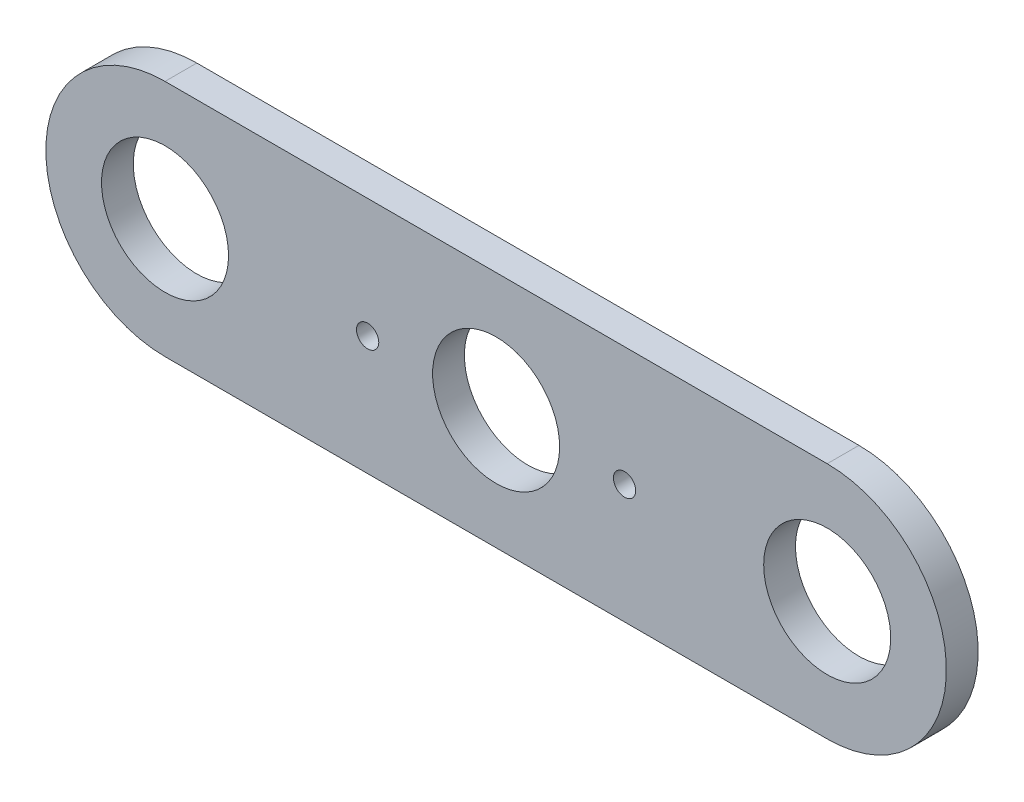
ISO-10303-21;
HEADER;
FILE_DESCRIPTION(('STEP AP214'),'2;1');
FILE_NAME('part.step','',(''),(''),'','','');
FILE_SCHEMA(('AUTOMOTIVE_DESIGN { 1 0 10303 214 1 1 1 1 }'));
ENDSEC;
DATA;
#1=APPLICATION_CONTEXT('core data for automotive mechanical design processes');
#2=APPLICATION_PROTOCOL_DEFINITION('international standard','automotive_design',2000,#1);
#3=PRODUCT_CONTEXT('',#1,'mechanical');
#4=PRODUCT('Part','Part','',(#3));
#5=PRODUCT_RELATED_PRODUCT_CATEGORY('part','',(#4));
#6=PRODUCT_DEFINITION_FORMATION('','',#4);
#7=PRODUCT_DEFINITION_CONTEXT('part definition',#1,'design');
#8=PRODUCT_DEFINITION('design','',#6,#7);
#9=PRODUCT_DEFINITION_SHAPE('','',#8);
#10=(LENGTH_UNIT() NAMED_UNIT(*) SI_UNIT(.MILLI.,.METRE.));
#11=(NAMED_UNIT(*) PLANE_ANGLE_UNIT() SI_UNIT($,.RADIAN.));
#12=(NAMED_UNIT(*) SI_UNIT($,.STERADIAN.) SOLID_ANGLE_UNIT());
#13=UNCERTAINTY_MEASURE_WITH_UNIT(LENGTH_MEASURE(1.E-05),#10,'distance_accuracy_value','');
#14=(GEOMETRIC_REPRESENTATION_CONTEXT(3) GLOBAL_UNCERTAINTY_ASSIGNED_CONTEXT((#13)) GLOBAL_UNIT_ASSIGNED_CONTEXT((#10,
#11,#12)) REPRESENTATION_CONTEXT('',''));
#15=CARTESIAN_POINT('',(0.,0.,0.));
#16=DIRECTION('',(0.,0.,1.));
#17=DIRECTION('',(1.,0.,0.));
#18=AXIS2_PLACEMENT_3D('',#15,#16,#17);
#19=CARTESIAN_POINT('',(62.5,0.,6.));
#20=DIRECTION('',(0.,0.,1.));
#21=DIRECTION('',(1.,0.,0.));
#22=AXIS2_PLACEMENT_3D('',#19,#20,#21);
#23=PLANE('',#22);
#24=CARTESIAN_POINT('',(-24.25,0.,6.));
#25=DIRECTION('',(0.,0.,1.));
#26=DIRECTION('',(1.,0.,0.));
#27=AXIS2_PLACEMENT_3D('',#24,#25,#26);
#28=CIRCLE('',#27,2.1);
#29=CARTESIAN_POINT('',(-22.15,0.,6.));
#30=VERTEX_POINT('',#29);
#31=EDGE_CURVE('E116',#30,#30,#28,.T.);
#32=ORIENTED_EDGE('',*,*,#31,.F.);
#33=EDGE_LOOP('',(#32));
#34=FACE_BOUND('',#33,.T.);
#35=CARTESIAN_POINT('',(24.25,0.,6.));
#36=DIRECTION('',(0.,0.,1.));
#37=DIRECTION('',(-1.,0.,0.));
#38=AXIS2_PLACEMENT_3D('',#35,#36,#37);
#39=CIRCLE('',#38,2.09999999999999);
#40=CARTESIAN_POINT('',(22.15,0.,6.));
#41=VERTEX_POINT('',#40);
#42=EDGE_CURVE('E122',#41,#41,#39,.T.);
#43=ORIENTED_EDGE('',*,*,#42,.F.);
#44=EDGE_LOOP('',(#43));
#45=FACE_BOUND('',#44,.T.);
#46=CARTESIAN_POINT('',(62.5,0.,6.));
#47=DIRECTION('',(0.,0.,1.));
#48=DIRECTION('',(-1.,0.,0.));
#49=AXIS2_PLACEMENT_3D('',#46,#47,#48);
#50=CIRCLE('',#49,11.99);
#51=CARTESIAN_POINT('',(50.51,0.,6.));
#52=VERTEX_POINT('',#51);
#53=EDGE_CURVE('E135',#52,#52,#50,.T.);
#54=ORIENTED_EDGE('',*,*,#53,.F.);
#55=EDGE_LOOP('',(#54));
#56=FACE_BOUND('',#55,.T.);
#57=CARTESIAN_POINT('',(62.5,0.,6.));
#58=DIRECTION('',(0.,0.,1.));
#59=DIRECTION('',(1.,0.,0.));
#60=AXIS2_PLACEMENT_3D('',#57,#58,#59);
#61=CIRCLE('',#60,22.5);
#62=CARTESIAN_POINT('',(62.5,-22.5,6.));
#63=VERTEX_POINT('',#62);
#64=CARTESIAN_POINT('',(62.5,22.5,6.));
#65=VERTEX_POINT('',#64);
#66=EDGE_CURVE('E93',#63,#65,#61,.T.);
#67=ORIENTED_EDGE('',*,*,#66,.T.);
#68=DIRECTION('',(-1.,0.,0.));
#69=VECTOR('',#68,1.);
#70=CARTESIAN_POINT('',(-62.5,22.5,6.));
#71=LINE('',#70,#69);
#72=CARTESIAN_POINT('',(-62.5,22.5,6.));
#73=VERTEX_POINT('',#72);
#74=EDGE_CURVE('E88',#65,#73,#71,.T.);
#75=ORIENTED_EDGE('',*,*,#74,.T.);
#76=CARTESIAN_POINT('',(-62.5,0.,6.));
#77=DIRECTION('',(0.,0.,1.));
#78=DIRECTION('',(-1.,0.,0.));
#79=AXIS2_PLACEMENT_3D('',#76,#77,#78);
#80=CIRCLE('',#79,22.5);
#81=CARTESIAN_POINT('',(-62.5,-22.5,6.));
#82=VERTEX_POINT('',#81);
#83=EDGE_CURVE('E91',#73,#82,#80,.T.);
#84=ORIENTED_EDGE('',*,*,#83,.T.);
#85=DIRECTION('',(1.,0.,0.));
#86=VECTOR('',#85,1.);
#87=CARTESIAN_POINT('',(-62.5,-22.5,6.));
#88=LINE('',#87,#86);
#89=EDGE_CURVE('E58',#82,#63,#88,.T.);
#90=ORIENTED_EDGE('',*,*,#89,.T.);
#91=EDGE_LOOP('',(#67,#75,#84,#90));
#92=FACE_BOUND('',#91,.T.);
#93=CARTESIAN_POINT('',(-62.5,0.,6.));
#94=DIRECTION('',(0.,0.,1.));
#95=DIRECTION('',(1.,0.,0.));
#96=AXIS2_PLACEMENT_3D('',#93,#94,#95);
#97=CIRCLE('',#96,11.99);
#98=CARTESIAN_POINT('',(-50.51,0.,6.));
#99=VERTEX_POINT('',#98);
#100=EDGE_CURVE('E109',#99,#99,#97,.T.);
#101=ORIENTED_EDGE('',*,*,#100,.F.);
#102=EDGE_LOOP('',(#101));
#103=FACE_BOUND('',#102,.T.);
#104=CARTESIAN_POINT('',(0.,0.,6.));
#105=DIRECTION('',(0.,0.,1.));
#106=DIRECTION('',(1.,0.,0.));
#107=AXIS2_PLACEMENT_3D('',#104,#105,#106);
#108=CIRCLE('',#107,11.99);
#109=CARTESIAN_POINT('',(11.99,0.,6.));
#110=VERTEX_POINT('',#109);
#111=EDGE_CURVE('E129',#110,#110,#108,.T.);
#112=ORIENTED_EDGE('',*,*,#111,.F.);
#113=EDGE_LOOP('',(#112));
#114=FACE_BOUND('',#113,.T.);
#115=ADVANCED_FACE('F39',(#34,#45,#56,#92,#103,#114),#23,.T.);
#116=CARTESIAN_POINT('',(62.5,0.,0.));
#117=DIRECTION('',(0.,0.,1.));
#118=DIRECTION('',(1.,0.,0.));
#119=AXIS2_PLACEMENT_3D('',#116,#117,#118);
#120=PLANE('',#119);
#121=CARTESIAN_POINT('',(-24.25,0.,0.));
#122=DIRECTION('',(0.,0.,1.));
#123=DIRECTION('',(1.,0.,0.));
#124=AXIS2_PLACEMENT_3D('',#121,#122,#123);
#125=CIRCLE('',#124,2.1);
#126=CARTESIAN_POINT('',(-22.15,0.,0.));
#127=VERTEX_POINT('',#126);
#128=EDGE_CURVE('E43',#127,#127,#125,.T.);
#129=ORIENTED_EDGE('',*,*,#128,.T.);
#130=EDGE_LOOP('',(#129));
#131=FACE_BOUND('',#130,.T.);
#132=CARTESIAN_POINT('',(24.25,0.,0.));
#133=DIRECTION('',(0.,0.,1.));
#134=DIRECTION('',(1.,0.,0.));
#135=AXIS2_PLACEMENT_3D('',#132,#133,#134);
#136=CIRCLE('',#135,2.09999999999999);
#137=CARTESIAN_POINT('',(26.35,0.,0.));
#138=VERTEX_POINT('',#137);
#139=EDGE_CURVE('E114',#138,#138,#136,.T.);
#140=ORIENTED_EDGE('',*,*,#139,.T.);
#141=EDGE_LOOP('',(#140));
#142=FACE_BOUND('',#141,.T.);
#143=CARTESIAN_POINT('',(62.5,0.,0.));
#144=DIRECTION('',(0.,0.,1.));
#145=DIRECTION('',(1.,0.,0.));
#146=AXIS2_PLACEMENT_3D('',#143,#144,#145);
#147=CIRCLE('',#146,22.5);
#148=CARTESIAN_POINT('',(62.5,-22.5,0.));
#149=VERTEX_POINT('',#148);
#150=CARTESIAN_POINT('',(62.5,22.5,0.));
#151=VERTEX_POINT('',#150);
#152=EDGE_CURVE('E106',#149,#151,#147,.T.);
#153=ORIENTED_EDGE('',*,*,#152,.F.);
#154=DIRECTION('',(1.,0.,0.));
#155=VECTOR('',#154,1.);
#156=CARTESIAN_POINT('',(-62.5,-22.5,0.));
#157=LINE('',#156,#155);
#158=CARTESIAN_POINT('',(-62.5,-22.5,0.));
#159=VERTEX_POINT('',#158);
#160=EDGE_CURVE('E81',#159,#149,#157,.T.);
#161=ORIENTED_EDGE('',*,*,#160,.F.);
#162=CARTESIAN_POINT('',(-62.5,0.,0.));
#163=DIRECTION('',(0.,0.,1.));
#164=DIRECTION('',(-1.,0.,0.));
#165=AXIS2_PLACEMENT_3D('',#162,#163,#164);
#166=CIRCLE('',#165,22.5);
#167=CARTESIAN_POINT('',(-62.5,22.5,0.));
#168=VERTEX_POINT('',#167);
#169=EDGE_CURVE('E75',#168,#159,#166,.T.);
#170=ORIENTED_EDGE('',*,*,#169,.F.);
#171=DIRECTION('',(-1.,0.,0.));
#172=VECTOR('',#171,1.);
#173=CARTESIAN_POINT('',(-62.5,22.5,0.));
#174=LINE('',#173,#172);
#175=EDGE_CURVE('E97',#151,#168,#174,.T.);
#176=ORIENTED_EDGE('',*,*,#175,.F.);
#177=EDGE_LOOP('',(#153,#161,#170,#176));
#178=FACE_BOUND('',#177,.T.);
#179=CARTESIAN_POINT('',(-62.5,0.,0.));
#180=DIRECTION('',(0.,0.,1.));
#181=DIRECTION('',(1.,0.,0.));
#182=AXIS2_PLACEMENT_3D('',#179,#180,#181);
#183=CIRCLE('',#182,11.99);
#184=CARTESIAN_POINT('',(-50.51,0.,0.));
#185=VERTEX_POINT('',#184);
#186=EDGE_CURVE('E138',#185,#185,#183,.T.);
#187=ORIENTED_EDGE('',*,*,#186,.T.);
#188=EDGE_LOOP('',(#187));
#189=FACE_BOUND('',#188,.T.);
#190=CARTESIAN_POINT('',(62.5,0.,0.));
#191=DIRECTION('',(0.,0.,1.));
#192=DIRECTION('',(-1.,0.,0.));
#193=AXIS2_PLACEMENT_3D('',#190,#191,#192);
#194=CIRCLE('',#193,11.99);
#195=CARTESIAN_POINT('',(50.51,0.,0.));
#196=VERTEX_POINT('',#195);
#197=EDGE_CURVE('E132',#196,#196,#194,.T.);
#198=ORIENTED_EDGE('',*,*,#197,.T.);
#199=EDGE_LOOP('',(#198));
#200=FACE_BOUND('',#199,.T.);
#201=CARTESIAN_POINT('',(0.,0.,0.));
#202=DIRECTION('',(0.,0.,1.));
#203=DIRECTION('',(1.,0.,0.));
#204=AXIS2_PLACEMENT_3D('',#201,#202,#203);
#205=CIRCLE('',#204,11.99);
#206=CARTESIAN_POINT('',(11.99,0.,0.));
#207=VERTEX_POINT('',#206);
#208=EDGE_CURVE('E120',#207,#207,#205,.T.);
#209=ORIENTED_EDGE('',*,*,#208,.T.);
#210=EDGE_LOOP('',(#209));
#211=FACE_BOUND('',#210,.T.);
#212=ADVANCED_FACE('F146',(#131,#142,#178,#189,#200,#211),#120,.F.);
#213=CARTESIAN_POINT('',(62.5,0.,6.));
#214=DIRECTION('',(0.,0.,-1.));
#215=DIRECTION('',(-1.,0.,0.));
#216=AXIS2_PLACEMENT_3D('',#213,#214,#215);
#217=CYLINDRICAL_SURFACE('',#216,22.5);
#218=ORIENTED_EDGE('',*,*,#152,.T.);
#219=DIRECTION('',(0.,0.,-1.));
#220=VECTOR('',#219,1.);
#221=CARTESIAN_POINT('',(62.5,22.5,6.));
#222=LINE('',#221,#220);
#223=EDGE_CURVE('E11',#65,#151,#222,.T.);
#224=ORIENTED_EDGE('',*,*,#223,.F.);
#225=ORIENTED_EDGE('',*,*,#66,.F.);
#226=DIRECTION('',(0.,0.,-1.));
#227=VECTOR('',#226,1.);
#228=CARTESIAN_POINT('',(62.5,-22.5,6.));
#229=LINE('',#228,#227);
#230=EDGE_CURVE('E102',#63,#149,#229,.T.);
#231=ORIENTED_EDGE('',*,*,#230,.T.);
#232=EDGE_LOOP('',(#218,#224,#225,#231));
#233=FACE_BOUND('',#232,.T.);
#234=ADVANCED_FACE('F41',(#233),#217,.T.);
#235=CARTESIAN_POINT('',(-62.5,22.5,6.));
#236=DIRECTION('',(0.,-1.,0.));
#237=DIRECTION('',(1.,0.,0.));
#238=AXIS2_PLACEMENT_3D('',#235,#236,#237);
#239=PLANE('',#238);
#240=ORIENTED_EDGE('',*,*,#175,.T.);
#241=DIRECTION('',(0.,0.,-1.));
#242=VECTOR('',#241,1.);
#243=CARTESIAN_POINT('',(-62.5,22.5,6.));
#244=LINE('',#243,#242);
#245=EDGE_CURVE('E49',#73,#168,#244,.T.);
#246=ORIENTED_EDGE('',*,*,#245,.F.);
#247=ORIENTED_EDGE('',*,*,#74,.F.);
#248=ORIENTED_EDGE('',*,*,#223,.T.);
#249=EDGE_LOOP('',(#240,#246,#247,#248));
#250=FACE_BOUND('',#249,.T.);
#251=ADVANCED_FACE('F96',(#250),#239,.F.);
#252=CARTESIAN_POINT('',(-62.5,0.,6.));
#253=DIRECTION('',(0.,0.,-1.));
#254=DIRECTION('',(-1.,0.,0.));
#255=AXIS2_PLACEMENT_3D('',#252,#253,#254);
#256=CYLINDRICAL_SURFACE('',#255,22.5);
#257=ORIENTED_EDGE('',*,*,#169,.T.);
#258=DIRECTION('',(0.,0.,-1.));
#259=VECTOR('',#258,1.);
#260=CARTESIAN_POINT('',(-62.5,-22.5,6.));
#261=LINE('',#260,#259);
#262=EDGE_CURVE('E98',#82,#159,#261,.T.);
#263=ORIENTED_EDGE('',*,*,#262,.F.);
#264=ORIENTED_EDGE('',*,*,#83,.F.);
#265=ORIENTED_EDGE('',*,*,#245,.T.);
#266=EDGE_LOOP('',(#257,#263,#264,#265));
#267=FACE_BOUND('',#266,.T.);
#268=ADVANCED_FACE('F100',(#267),#256,.T.);
#269=CARTESIAN_POINT('',(-62.5,-22.5,6.));
#270=DIRECTION('',(0.,1.,0.));
#271=DIRECTION('',(-1.,0.,0.));
#272=AXIS2_PLACEMENT_3D('',#269,#270,#271);
#273=PLANE('',#272);
#274=ORIENTED_EDGE('',*,*,#160,.T.);
#275=ORIENTED_EDGE('',*,*,#230,.F.);
#276=ORIENTED_EDGE('',*,*,#89,.F.);
#277=ORIENTED_EDGE('',*,*,#262,.T.);
#278=EDGE_LOOP('',(#274,#275,#276,#277));
#279=FACE_BOUND('',#278,.T.);
#280=ADVANCED_FACE('F152',(#279),#273,.F.);
#281=CARTESIAN_POINT('',(-62.5,0.,6.));
#282=DIRECTION('',(0.,0.,-1.));
#283=DIRECTION('',(-1.,0.,0.));
#284=AXIS2_PLACEMENT_3D('',#281,#282,#283);
#285=CYLINDRICAL_SURFACE('',#284,11.99);
#286=ORIENTED_EDGE('',*,*,#100,.T.);
#287=EDGE_LOOP('',(#286));
#288=FACE_BOUND('',#287,.T.);
#289=ORIENTED_EDGE('',*,*,#186,.F.);
#290=EDGE_LOOP('',(#289));
#291=FACE_BOUND('',#290,.T.);
#292=ADVANCED_FACE('F149',(#288,#291),#285,.F.);
#293=CARTESIAN_POINT('',(62.5,0.,6.));
#294=DIRECTION('',(0.,0.,-1.));
#295=DIRECTION('',(-1.,0.,0.));
#296=AXIS2_PLACEMENT_3D('',#293,#294,#295);
#297=CYLINDRICAL_SURFACE('',#296,11.99);
#298=ORIENTED_EDGE('',*,*,#53,.T.);
#299=EDGE_LOOP('',(#298));
#300=FACE_BOUND('',#299,.T.);
#301=ORIENTED_EDGE('',*,*,#197,.F.);
#302=EDGE_LOOP('',(#301));
#303=FACE_BOUND('',#302,.T.);
#304=ADVANCED_FACE('F151',(#300,#303),#297,.F.);
#305=CARTESIAN_POINT('',(0.,0.,6.));
#306=DIRECTION('',(0.,0.,-1.));
#307=DIRECTION('',(-1.,0.,0.));
#308=AXIS2_PLACEMENT_3D('',#305,#306,#307);
#309=CYLINDRICAL_SURFACE('',#308,11.99);
#310=ORIENTED_EDGE('',*,*,#111,.T.);
#311=EDGE_LOOP('',(#310));
#312=FACE_BOUND('',#311,.T.);
#313=ORIENTED_EDGE('',*,*,#208,.F.);
#314=EDGE_LOOP('',(#313));
#315=FACE_BOUND('',#314,.T.);
#316=ADVANCED_FACE('F159',(#312,#315),#309,.F.);
#317=CARTESIAN_POINT('',(24.25,0.,-4.));
#318=DIRECTION('',(0.,0.,1.));
#319=DIRECTION('',(1.,0.,0.));
#320=AXIS2_PLACEMENT_3D('',#317,#318,#319);
#321=CYLINDRICAL_SURFACE('',#320,2.09999999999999);
#322=ORIENTED_EDGE('',*,*,#42,.T.);
#323=EDGE_LOOP('',(#322));
#324=FACE_BOUND('',#323,.T.);
#325=ORIENTED_EDGE('',*,*,#139,.F.);
#326=EDGE_LOOP('',(#325));
#327=FACE_BOUND('',#326,.T.);
#328=ADVANCED_FACE('F223',(#324,#327),#321,.F.);
#329=CARTESIAN_POINT('',(-24.25,0.,-4.));
#330=DIRECTION('',(0.,0.,1.));
#331=DIRECTION('',(1.,0.,0.));
#332=AXIS2_PLACEMENT_3D('',#329,#330,#331);
#333=CYLINDRICAL_SURFACE('',#332,2.1);
#334=ORIENTED_EDGE('',*,*,#31,.T.);
#335=EDGE_LOOP('',(#334));
#336=FACE_BOUND('',#335,.T.);
#337=ORIENTED_EDGE('',*,*,#128,.F.);
#338=EDGE_LOOP('',(#337));
#339=FACE_BOUND('',#338,.T.);
#340=ADVANCED_FACE('F233',(#336,#339),#333,.F.);
#341=CLOSED_SHELL('',(#115,#212,#234,#251,#268,#280,#292,#304,#316,#328,#340));
#342=MANIFOLD_SOLID_BREP('B2',#341);
#343=ADVANCED_BREP_SHAPE_REPRESENTATION('',(#18,#342),#14);
#344=SHAPE_DEFINITION_REPRESENTATION(#9,#343);
ENDSEC;
END-ISO-10303-21;
